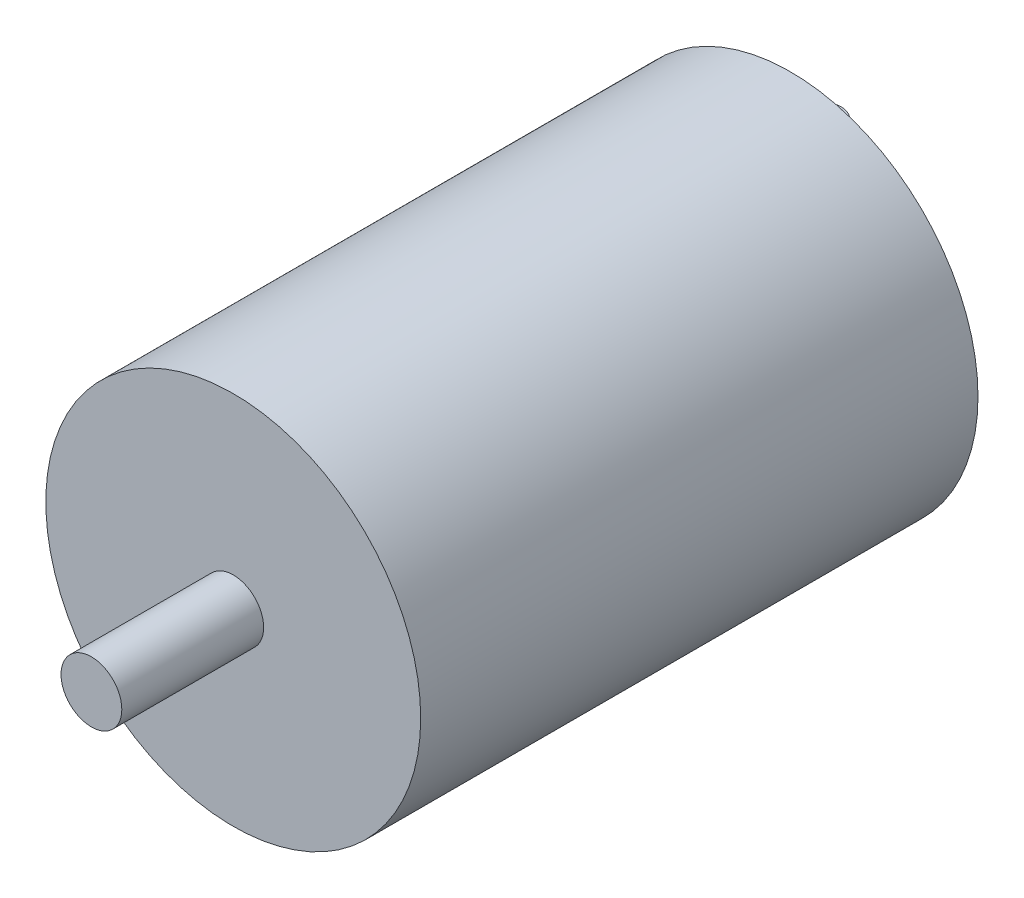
ISO-10303-21;
HEADER;
FILE_DESCRIPTION(('STEP AP214'),'2;1');
FILE_NAME('part.step','',(''),(''),'','','');
FILE_SCHEMA(('AUTOMOTIVE_DESIGN { 1 0 10303 214 1 1 1 1 }'));
ENDSEC;
DATA;
#1=APPLICATION_CONTEXT('core data for automotive mechanical design processes');
#2=APPLICATION_PROTOCOL_DEFINITION('international standard','automotive_design',2000,#1);
#3=PRODUCT_CONTEXT('',#1,'mechanical');
#4=PRODUCT('Part','Part','',(#3));
#5=PRODUCT_RELATED_PRODUCT_CATEGORY('part','',(#4));
#6=PRODUCT_DEFINITION_FORMATION('','',#4);
#7=PRODUCT_DEFINITION_CONTEXT('part definition',#1,'design');
#8=PRODUCT_DEFINITION('design','',#6,#7);
#9=PRODUCT_DEFINITION_SHAPE('','',#8);
#10=(LENGTH_UNIT() NAMED_UNIT(*) SI_UNIT(.MILLI.,.METRE.));
#11=(NAMED_UNIT(*) PLANE_ANGLE_UNIT() SI_UNIT($,.RADIAN.));
#12=(NAMED_UNIT(*) SI_UNIT($,.STERADIAN.) SOLID_ANGLE_UNIT());
#13=UNCERTAINTY_MEASURE_WITH_UNIT(LENGTH_MEASURE(1.E-05),#10,'distance_accuracy_value','');
#14=(GEOMETRIC_REPRESENTATION_CONTEXT(3) GLOBAL_UNCERTAINTY_ASSIGNED_CONTEXT((#13)) GLOBAL_UNIT_ASSIGNED_CONTEXT((#10,
#11,#12)) REPRESENTATION_CONTEXT('',''));
#15=CARTESIAN_POINT('',(0.,0.,0.));
#16=DIRECTION('',(0.,0.,1.));
#17=DIRECTION('',(1.,0.,0.));
#18=AXIS2_PLACEMENT_3D('',#15,#16,#17);
#19=CARTESIAN_POINT('',(0.,0.,0.));
#20=DIRECTION('',(0.,0.,1.));
#21=DIRECTION('',(1.,0.,0.));
#22=AXIS2_PLACEMENT_3D('',#19,#20,#21);
#23=PLANE('',#22);
#24=DIRECTION('',(0.,1.,0.));
#25=VECTOR('',#24,1.);
#26=CARTESIAN_POINT('',(-2.,-12.,0.));
#27=LINE('',#26,#25);
#28=CARTESIAN_POINT('',(-2.,-13.,0.));
#29=VERTEX_POINT('',#28);
#30=CARTESIAN_POINT('',(-2.,-12.,0.));
#31=VERTEX_POINT('',#30);
#32=EDGE_CURVE('E141',#29,#31,#27,.T.);
#33=ORIENTED_EDGE('',*,*,#32,.F.);
#34=DIRECTION('',(-1.,0.,0.));
#35=VECTOR('',#34,1.);
#36=CARTESIAN_POINT('',(2.,-13.,0.));
#37=LINE('',#36,#35);
#38=CARTESIAN_POINT('',(2.,-13.,0.));
#39=VERTEX_POINT('',#38);
#40=EDGE_CURVE('E174',#39,#29,#37,.T.);
#41=ORIENTED_EDGE('',*,*,#40,.F.);
#42=DIRECTION('',(0.,-1.,0.));
#43=VECTOR('',#42,1.);
#44=CARTESIAN_POINT('',(2.,-12.,0.));
#45=LINE('',#44,#43);
#46=CARTESIAN_POINT('',(2.,-12.,0.));
#47=VERTEX_POINT('',#46);
#48=EDGE_CURVE('E178',#47,#39,#45,.T.);
#49=ORIENTED_EDGE('',*,*,#48,.F.);
#50=DIRECTION('',(1.,0.,0.));
#51=VECTOR('',#50,1.);
#52=CARTESIAN_POINT('',(2.,-12.,0.));
#53=LINE('',#52,#51);
#54=EDGE_CURVE('E182',#31,#47,#53,.T.);
#55=ORIENTED_EDGE('',*,*,#54,.F.);
#56=EDGE_LOOP('',(#33,#41,#49,#55));
#57=FACE_BOUND('',#56,.T.);
#58=CARTESIAN_POINT('',(0.,0.,0.));
#59=DIRECTION('',(0.,0.,1.));
#60=DIRECTION('',(1.,0.,0.));
#61=AXIS2_PLACEMENT_3D('',#58,#59,#60);
#62=CIRCLE('',#61,18.5);
#63=CARTESIAN_POINT('',(18.5,0.,0.));
#64=VERTEX_POINT('',#63);
#65=EDGE_CURVE('E192',#64,#64,#62,.T.);
#66=ORIENTED_EDGE('',*,*,#65,.F.);
#67=EDGE_LOOP('',(#66));
#68=FACE_BOUND('',#67,.T.);
#69=DIRECTION('',(0.,1.,0.));
#70=VECTOR('',#69,1.);
#71=CARTESIAN_POINT('',(-2.,13.,0.));
#72=LINE('',#71,#70);
#73=CARTESIAN_POINT('',(-2.,12.,0.));
#74=VERTEX_POINT('',#73);
#75=CARTESIAN_POINT('',(-2.,13.,0.));
#76=VERTEX_POINT('',#75);
#77=EDGE_CURVE('E124',#74,#76,#72,.T.);
#78=ORIENTED_EDGE('',*,*,#77,.F.);
#79=DIRECTION('',(-1.,0.,0.));
#80=VECTOR('',#79,1.);
#81=CARTESIAN_POINT('',(2.,12.,0.));
#82=LINE('',#81,#80);
#83=CARTESIAN_POINT('',(2.,12.,0.));
#84=VERTEX_POINT('',#83);
#85=EDGE_CURVE('E131',#84,#74,#82,.T.);
#86=ORIENTED_EDGE('',*,*,#85,.F.);
#87=DIRECTION('',(0.,-1.,0.));
#88=VECTOR('',#87,1.);
#89=CARTESIAN_POINT('',(2.,13.,0.));
#90=LINE('',#89,#88);
#91=CARTESIAN_POINT('',(2.,13.,0.));
#92=VERTEX_POINT('',#91);
#93=EDGE_CURVE('E146',#92,#84,#90,.T.);
#94=ORIENTED_EDGE('',*,*,#93,.F.);
#95=DIRECTION('',(1.,0.,0.));
#96=VECTOR('',#95,1.);
#97=CARTESIAN_POINT('',(2.,13.,0.));
#98=LINE('',#97,#96);
#99=EDGE_CURVE('E139',#76,#92,#98,.T.);
#100=ORIENTED_EDGE('',*,*,#99,.F.);
#101=EDGE_LOOP('',(#78,#86,#94,#100));
#102=FACE_BOUND('',#101,.T.);
#103=ADVANCED_FACE('F45',(#57,#68,#102),#23,.F.);
#104=CARTESIAN_POINT('',(0.,0.,55.));
#105=DIRECTION('',(0.,0.,-1.));
#106=DIRECTION('',(-1.,0.,0.));
#107=AXIS2_PLACEMENT_3D('',#104,#105,#106);
#108=CYLINDRICAL_SURFACE('',#107,18.5);
#109=CARTESIAN_POINT('',(0.,0.,55.));
#110=DIRECTION('',(0.,0.,1.));
#111=DIRECTION('',(1.,0.,0.));
#112=AXIS2_PLACEMENT_3D('',#109,#110,#111);
#113=CIRCLE('',#112,18.5);
#114=CARTESIAN_POINT('',(18.5,0.,55.));
#115=VERTEX_POINT('',#114);
#116=EDGE_CURVE('E198',#115,#115,#113,.T.);
#117=ORIENTED_EDGE('',*,*,#116,.F.);
#118=EDGE_LOOP('',(#117));
#119=FACE_BOUND('',#118,.T.);
#120=ORIENTED_EDGE('',*,*,#65,.T.);
#121=EDGE_LOOP('',(#120));
#122=FACE_BOUND('',#121,.T.);
#123=ADVANCED_FACE('F287',(#119,#122),#108,.T.);
#124=CARTESIAN_POINT('',(0.,0.,55.));
#125=DIRECTION('',(0.,0.,1.));
#126=DIRECTION('',(1.,0.,0.));
#127=AXIS2_PLACEMENT_3D('',#124,#125,#126);
#128=PLANE('',#127);
#129=CARTESIAN_POINT('',(0.,0.,55.));
#130=DIRECTION('',(0.,0.,1.));
#131=DIRECTION('',(1.,0.,0.));
#132=AXIS2_PLACEMENT_3D('',#129,#130,#131);
#133=CIRCLE('',#132,3.);
#134=CARTESIAN_POINT('',(3.,0.,55.));
#135=VERTEX_POINT('',#134);
#136=EDGE_CURVE('E193',#135,#135,#133,.T.);
#137=ORIENTED_EDGE('',*,*,#136,.F.);
#138=EDGE_LOOP('',(#137));
#139=FACE_BOUND('',#138,.T.);
#140=ORIENTED_EDGE('',*,*,#116,.T.);
#141=EDGE_LOOP('',(#140));
#142=FACE_BOUND('',#141,.T.);
#143=ADVANCED_FACE('F294',(#139,#142),#128,.T.);
#144=CARTESIAN_POINT('',(0.,0.,69.));
#145=DIRECTION('',(0.,0.,-1.));
#146=DIRECTION('',(-1.,0.,0.));
#147=AXIS2_PLACEMENT_3D('',#144,#145,#146);
#148=CYLINDRICAL_SURFACE('',#147,3.);
#149=CARTESIAN_POINT('',(0.,0.,69.));
#150=DIRECTION('',(0.,0.,1.));
#151=DIRECTION('',(1.,0.,0.));
#152=AXIS2_PLACEMENT_3D('',#149,#150,#151);
#153=CIRCLE('',#152,3.);
#154=CARTESIAN_POINT('',(3.,0.,69.));
#155=VERTEX_POINT('',#154);
#156=EDGE_CURVE('E160',#155,#155,#153,.T.);
#157=ORIENTED_EDGE('',*,*,#156,.F.);
#158=EDGE_LOOP('',(#157));
#159=FACE_BOUND('',#158,.T.);
#160=ORIENTED_EDGE('',*,*,#136,.T.);
#161=EDGE_LOOP('',(#160));
#162=FACE_BOUND('',#161,.T.);
#163=ADVANCED_FACE('F415',(#159,#162),#148,.T.);
#164=CARTESIAN_POINT('',(0.,0.,69.));
#165=DIRECTION('',(0.,0.,1.));
#166=DIRECTION('',(1.,0.,0.));
#167=AXIS2_PLACEMENT_3D('',#164,#165,#166);
#168=PLANE('',#167);
#169=ORIENTED_EDGE('',*,*,#156,.T.);
#170=EDGE_LOOP('',(#169));
#171=FACE_BOUND('',#170,.T.);
#172=ADVANCED_FACE('F384',(#171),#168,.T.);
#173=CARTESIAN_POINT('',(-2.,-12.,-5.));
#174=DIRECTION('',(1.,0.,0.));
#175=DIRECTION('',(0.,0.,-1.));
#176=AXIS2_PLACEMENT_3D('',#173,#174,#175);
#177=PLANE('',#176);
#178=DIRECTION('',(0.,0.,1.));
#179=VECTOR('',#178,1.);
#180=CARTESIAN_POINT('',(-2.,-12.,-5.));
#181=LINE('',#180,#179);
#182=CARTESIAN_POINT('',(-2.,-12.,-3.));
#183=VERTEX_POINT('',#182);
#184=EDGE_CURVE('E161',#183,#31,#181,.T.);
#185=ORIENTED_EDGE('',*,*,#184,.F.);
#186=DIRECTION('',(0.,1.,0.));
#187=VECTOR('',#186,1.);
#188=CARTESIAN_POINT('',(-2.,-13.,-3.));
#189=LINE('',#188,#187);
#190=CARTESIAN_POINT('',(-2.,-13.,-3.));
#191=VERTEX_POINT('',#190);
#192=EDGE_CURVE('E226',#183,#191,#189,.F.);
#193=ORIENTED_EDGE('',*,*,#192,.T.);
#194=DIRECTION('',(0.,0.,1.));
#195=VECTOR('',#194,1.);
#196=CARTESIAN_POINT('',(-2.,-13.,-5.));
#197=LINE('',#196,#195);
#198=EDGE_CURVE('E171',#191,#29,#197,.T.);
#199=ORIENTED_EDGE('',*,*,#198,.T.);
#200=ORIENTED_EDGE('',*,*,#32,.T.);
#201=EDGE_LOOP('',(#185,#193,#199,#200));
#202=FACE_BOUND('',#201,.T.);
#203=ADVANCED_FACE('F376',(#202),#177,.F.);
#204=CARTESIAN_POINT('',(2.,-12.,-5.));
#205=DIRECTION('',(0.,-1.,0.));
#206=DIRECTION('',(0.,0.,-1.));
#207=AXIS2_PLACEMENT_3D('',#204,#205,#206);
#208=PLANE('',#207);
#209=CARTESIAN_POINT('',(0.,-12.,-3.2));
#210=DIRECTION('',(0.,-1.,0.));
#211=DIRECTION('',(0.,0.,-1.));
#212=AXIS2_PLACEMENT_3D('',#209,#210,#211);
#213=CIRCLE('',#212,0.75);
#214=CARTESIAN_POINT('',(0.,-12.,-3.95));
#215=VERTEX_POINT('',#214);
#216=EDGE_CURVE('E165',#215,#215,#213,.T.);
#217=ORIENTED_EDGE('',*,*,#216,.T.);
#218=EDGE_LOOP('',(#217));
#219=FACE_BOUND('',#218,.T.);
#220=DIRECTION('',(0.,0.,1.));
#221=VECTOR('',#220,1.);
#222=CARTESIAN_POINT('',(2.,-12.,-5.));
#223=LINE('',#222,#221);
#224=CARTESIAN_POINT('',(2.,-12.,-3.));
#225=VERTEX_POINT('',#224);
#226=EDGE_CURVE('E164',#225,#47,#223,.T.);
#227=ORIENTED_EDGE('',*,*,#226,.F.);
#228=CARTESIAN_POINT('',(0.,-12.,-3.));
#229=DIRECTION('',(0.,-1.,0.));
#230=DIRECTION('',(0.,0.,-1.));
#231=AXIS2_PLACEMENT_3D('',#228,#229,#230);
#232=CIRCLE('',#231,2.);
#233=CARTESIAN_POINT('',(0.,-12.,-5.));
#234=VERTEX_POINT('',#233);
#235=EDGE_CURVE('E223',#225,#234,#232,.F.);
#236=ORIENTED_EDGE('',*,*,#235,.T.);
#237=CARTESIAN_POINT('',(0.,-12.,-3.));
#238=DIRECTION('',(0.,-1.,0.));
#239=DIRECTION('',(0.,0.,-1.));
#240=AXIS2_PLACEMENT_3D('',#237,#238,#239);
#241=CIRCLE('',#240,2.);
#242=EDGE_CURVE('E220',#234,#183,#241,.F.);
#243=ORIENTED_EDGE('',*,*,#242,.T.);
#244=ORIENTED_EDGE('',*,*,#184,.T.);
#245=ORIENTED_EDGE('',*,*,#54,.T.);
#246=EDGE_LOOP('',(#227,#236,#243,#244,#245));
#247=FACE_BOUND('',#246,.T.);
#248=ADVANCED_FACE('F367',(#219,#247),#208,.F.);
#249=CARTESIAN_POINT('',(2.,-12.,-5.));
#250=DIRECTION('',(-1.,0.,0.));
#251=DIRECTION('',(0.,-1.,0.));
#252=AXIS2_PLACEMENT_3D('',#249,#250,#251);
#253=PLANE('',#252);
#254=DIRECTION('',(0.,0.,1.));
#255=VECTOR('',#254,1.);
#256=CARTESIAN_POINT('',(2.,-13.,-5.));
#257=LINE('',#256,#255);
#258=CARTESIAN_POINT('',(2.,-13.,-3.));
#259=VERTEX_POINT('',#258);
#260=EDGE_CURVE('E168',#259,#39,#257,.T.);
#261=ORIENTED_EDGE('',*,*,#260,.F.);
#262=DIRECTION('',(0.,-1.,0.));
#263=VECTOR('',#262,1.);
#264=CARTESIAN_POINT('',(2.,-12.,-3.));
#265=LINE('',#264,#263);
#266=EDGE_CURVE('E216',#259,#225,#265,.F.);
#267=ORIENTED_EDGE('',*,*,#266,.T.);
#268=ORIENTED_EDGE('',*,*,#226,.T.);
#269=ORIENTED_EDGE('',*,*,#48,.T.);
#270=EDGE_LOOP('',(#261,#267,#268,#269));
#271=FACE_BOUND('',#270,.T.);
#272=ADVANCED_FACE('F358',(#271),#253,.F.);
#273=CARTESIAN_POINT('',(2.,-13.,-5.));
#274=DIRECTION('',(0.,1.,0.));
#275=DIRECTION('',(0.,0.,1.));
#276=AXIS2_PLACEMENT_3D('',#273,#274,#275);
#277=PLANE('',#276);
#278=CARTESIAN_POINT('',(0.,-13.,-3.2));
#279=DIRECTION('',(0.,-1.,0.));
#280=DIRECTION('',(0.,0.,-1.));
#281=AXIS2_PLACEMENT_3D('',#278,#279,#280);
#282=CIRCLE('',#281,0.75);
#283=CARTESIAN_POINT('',(0.,-13.,-3.95));
#284=VERTEX_POINT('',#283);
#285=EDGE_CURVE('E210',#284,#284,#282,.T.);
#286=ORIENTED_EDGE('',*,*,#285,.F.);
#287=EDGE_LOOP('',(#286));
#288=FACE_BOUND('',#287,.T.);
#289=CARTESIAN_POINT('',(0.,-13.,-3.));
#290=DIRECTION('',(0.,1.,0.));
#291=DIRECTION('',(0.,0.,1.));
#292=AXIS2_PLACEMENT_3D('',#289,#290,#291);
#293=CIRCLE('',#292,2.);
#294=CARTESIAN_POINT('',(0.,-13.,-5.));
#295=VERTEX_POINT('',#294);
#296=EDGE_CURVE('E197',#191,#295,#293,.F.);
#297=ORIENTED_EDGE('',*,*,#296,.T.);
#298=CARTESIAN_POINT('',(0.,-13.,-3.));
#299=DIRECTION('',(0.,1.,0.));
#300=DIRECTION('',(0.,0.,1.));
#301=AXIS2_PLACEMENT_3D('',#298,#299,#300);
#302=CIRCLE('',#301,2.);
#303=EDGE_CURVE('E213',#295,#259,#302,.F.);
#304=ORIENTED_EDGE('',*,*,#303,.T.);
#305=ORIENTED_EDGE('',*,*,#260,.T.);
#306=ORIENTED_EDGE('',*,*,#40,.T.);
#307=ORIENTED_EDGE('',*,*,#198,.F.);
#308=EDGE_LOOP('',(#297,#304,#305,#306,#307));
#309=FACE_BOUND('',#308,.T.);
#310=ADVANCED_FACE('F350',(#288,#309),#277,.F.);
#311=CARTESIAN_POINT('',(-2.,13.,-5.));
#312=DIRECTION('',(1.,0.,0.));
#313=DIRECTION('',(0.,0.,-1.));
#314=AXIS2_PLACEMENT_3D('',#311,#312,#313);
#315=PLANE('',#314);
#316=DIRECTION('',(0.,0.,1.));
#317=VECTOR('',#316,1.);
#318=CARTESIAN_POINT('',(-2.,13.,-5.));
#319=LINE('',#318,#317);
#320=CARTESIAN_POINT('',(-2.,13.,-3.));
#321=VERTEX_POINT('',#320);
#322=EDGE_CURVE('E157',#321,#76,#319,.T.);
#323=ORIENTED_EDGE('',*,*,#322,.F.);
#324=DIRECTION('',(0.,1.,0.));
#325=VECTOR('',#324,1.);
#326=CARTESIAN_POINT('',(-2.,12.,-3.));
#327=LINE('',#326,#325);
#328=CARTESIAN_POINT('',(-2.,12.,-3.));
#329=VERTEX_POINT('',#328);
#330=EDGE_CURVE('E11',#321,#329,#327,.F.);
#331=ORIENTED_EDGE('',*,*,#330,.T.);
#332=DIRECTION('',(0.,0.,1.));
#333=VECTOR('',#332,1.);
#334=CARTESIAN_POINT('',(-2.,12.,-5.));
#335=LINE('',#334,#333);
#336=EDGE_CURVE('E121',#329,#74,#335,.T.);
#337=ORIENTED_EDGE('',*,*,#336,.T.);
#338=ORIENTED_EDGE('',*,*,#77,.T.);
#339=EDGE_LOOP('',(#323,#331,#337,#338));
#340=FACE_BOUND('',#339,.T.);
#341=ADVANCED_FACE('F123',(#340),#315,.F.);
#342=CARTESIAN_POINT('',(2.,13.,-5.));
#343=DIRECTION('',(0.,-1.,0.));
#344=DIRECTION('',(0.,0.,-1.));
#345=AXIS2_PLACEMENT_3D('',#342,#343,#344);
#346=PLANE('',#345);
#347=CARTESIAN_POINT('',(0.,13.,-3.2));
#348=DIRECTION('',(0.,-1.,0.));
#349=DIRECTION('',(0.,0.,-1.));
#350=AXIS2_PLACEMENT_3D('',#347,#348,#349);
#351=CIRCLE('',#350,0.75);
#352=CARTESIAN_POINT('',(0.,13.,-3.95));
#353=VERTEX_POINT('',#352);
#354=EDGE_CURVE('E209',#353,#353,#351,.T.);
#355=ORIENTED_EDGE('',*,*,#354,.T.);
#356=EDGE_LOOP('',(#355));
#357=FACE_BOUND('',#356,.T.);
#358=DIRECTION('',(0.,0.,1.));
#359=VECTOR('',#358,1.);
#360=CARTESIAN_POINT('',(2.,13.,-5.));
#361=LINE('',#360,#359);
#362=CARTESIAN_POINT('',(2.,13.,-3.));
#363=VERTEX_POINT('',#362);
#364=EDGE_CURVE('E154',#363,#92,#361,.T.);
#365=ORIENTED_EDGE('',*,*,#364,.F.);
#366=CARTESIAN_POINT('',(0.,13.,-3.));
#367=DIRECTION('',(0.,-1.,0.));
#368=DIRECTION('',(0.,0.,-1.));
#369=AXIS2_PLACEMENT_3D('',#366,#367,#368);
#370=CIRCLE('',#369,2.);
#371=CARTESIAN_POINT('',(0.,13.,-5.));
#372=VERTEX_POINT('',#371);
#373=EDGE_CURVE('E55',#363,#372,#370,.F.);
#374=ORIENTED_EDGE('',*,*,#373,.T.);
#375=CARTESIAN_POINT('',(0.,13.,-3.));
#376=DIRECTION('',(0.,-1.,0.));
#377=DIRECTION('',(0.,0.,-1.));
#378=AXIS2_PLACEMENT_3D('',#375,#376,#377);
#379=CIRCLE('',#378,2.);
#380=EDGE_CURVE('E63',#372,#321,#379,.F.);
#381=ORIENTED_EDGE('',*,*,#380,.T.);
#382=ORIENTED_EDGE('',*,*,#322,.T.);
#383=ORIENTED_EDGE('',*,*,#99,.T.);
#384=EDGE_LOOP('',(#365,#374,#381,#382,#383));
#385=FACE_BOUND('',#384,.T.);
#386=ADVANCED_FACE('F261',(#357,#385),#346,.F.);
#387=CARTESIAN_POINT('',(2.,13.,-5.));
#388=DIRECTION('',(-1.,0.,0.));
#389=DIRECTION('',(0.,-1.,0.));
#390=AXIS2_PLACEMENT_3D('',#387,#388,#389);
#391=PLANE('',#390);
#392=DIRECTION('',(0.,0.,1.));
#393=VECTOR('',#392,1.);
#394=CARTESIAN_POINT('',(2.,12.,-5.));
#395=LINE('',#394,#393);
#396=CARTESIAN_POINT('',(2.,12.,-3.));
#397=VERTEX_POINT('',#396);
#398=EDGE_CURVE('E130',#397,#84,#395,.T.);
#399=ORIENTED_EDGE('',*,*,#398,.F.);
#400=DIRECTION('',(0.,-1.,0.));
#401=VECTOR('',#400,1.);
#402=CARTESIAN_POINT('',(2.,13.,-3.));
#403=LINE('',#402,#401);
#404=EDGE_CURVE('E235',#397,#363,#403,.F.);
#405=ORIENTED_EDGE('',*,*,#404,.T.);
#406=ORIENTED_EDGE('',*,*,#364,.T.);
#407=ORIENTED_EDGE('',*,*,#93,.T.);
#408=EDGE_LOOP('',(#399,#405,#406,#407));
#409=FACE_BOUND('',#408,.T.);
#410=ADVANCED_FACE('F260',(#409),#391,.F.);
#411=CARTESIAN_POINT('',(2.,12.,-5.));
#412=DIRECTION('',(0.,1.,0.));
#413=DIRECTION('',(0.,0.,1.));
#414=AXIS2_PLACEMENT_3D('',#411,#412,#413);
#415=PLANE('',#414);
#416=CARTESIAN_POINT('',(0.,12.,-3.2));
#417=DIRECTION('',(0.,1.,0.));
#418=DIRECTION('',(0.,0.,1.));
#419=AXIS2_PLACEMENT_3D('',#416,#417,#418);
#420=CIRCLE('',#419,0.75);
#421=CARTESIAN_POINT('',(0.,12.,-2.45));
#422=VERTEX_POINT('',#421);
#423=EDGE_CURVE('E205',#422,#422,#420,.T.);
#424=ORIENTED_EDGE('',*,*,#423,.T.);
#425=EDGE_LOOP('',(#424));
#426=FACE_BOUND('',#425,.T.);
#427=CARTESIAN_POINT('',(0.,12.,-3.));
#428=DIRECTION('',(0.,1.,0.));
#429=DIRECTION('',(0.,0.,1.));
#430=AXIS2_PLACEMENT_3D('',#427,#428,#429);
#431=CIRCLE('',#430,2.);
#432=CARTESIAN_POINT('',(0.,12.,-5.));
#433=VERTEX_POINT('',#432);
#434=EDGE_CURVE('E229',#329,#433,#431,.F.);
#435=ORIENTED_EDGE('',*,*,#434,.T.);
#436=CARTESIAN_POINT('',(0.,12.,-3.));
#437=DIRECTION('',(0.,1.,0.));
#438=DIRECTION('',(0.,0.,1.));
#439=AXIS2_PLACEMENT_3D('',#436,#437,#438);
#440=CIRCLE('',#439,2.);
#441=EDGE_CURVE('E232',#433,#397,#440,.F.);
#442=ORIENTED_EDGE('',*,*,#441,.T.);
#443=ORIENTED_EDGE('',*,*,#398,.T.);
#444=ORIENTED_EDGE('',*,*,#85,.T.);
#445=ORIENTED_EDGE('',*,*,#336,.F.);
#446=EDGE_LOOP('',(#435,#442,#443,#444,#445));
#447=FACE_BOUND('',#446,.T.);
#448=ADVANCED_FACE('F143',(#426,#447),#415,.F.);
#449=CARTESIAN_POINT('',(0.,37.,-3.2));
#450=DIRECTION('',(0.,-1.,0.));
#451=DIRECTION('',(0.,0.,-1.));
#452=AXIS2_PLACEMENT_3D('',#449,#450,#451);
#453=CYLINDRICAL_SURFACE('',#452,0.75);
#454=ORIENTED_EDGE('',*,*,#423,.F.);
#455=EDGE_LOOP('',(#454));
#456=FACE_BOUND('',#455,.T.);
#457=ORIENTED_EDGE('',*,*,#354,.F.);
#458=EDGE_LOOP('',(#457));
#459=FACE_BOUND('',#458,.T.);
#460=ADVANCED_FACE('F272',(#456,#459),#453,.F.);
#461=ORIENTED_EDGE('',*,*,#285,.T.);
#462=EDGE_LOOP('',(#461));
#463=FACE_BOUND('',#462,.T.);
#464=ORIENTED_EDGE('',*,*,#216,.F.);
#465=EDGE_LOOP('',(#464));
#466=FACE_BOUND('',#465,.T.);
#467=ADVANCED_FACE('F274',(#463,#466),#453,.F.);
#468=CARTESIAN_POINT('',(0.,0.,-3.));
#469=DIRECTION('',(0.,-1.,0.));
#470=DIRECTION('',(0.,0.,-1.));
#471=AXIS2_PLACEMENT_3D('',#468,#469,#470);
#472=CYLINDRICAL_SURFACE('',#471,2.);
#473=ORIENTED_EDGE('',*,*,#192,.F.);
#474=ORIENTED_EDGE('',*,*,#242,.F.);
#475=DIRECTION('',(0.,1.,0.));
#476=VECTOR('',#475,1.);
#477=CARTESIAN_POINT('',(0.,-12.,-5.));
#478=LINE('',#477,#476);
#479=EDGE_CURVE('E242',#295,#234,#478,.T.);
#480=ORIENTED_EDGE('',*,*,#479,.F.);
#481=ORIENTED_EDGE('',*,*,#296,.F.);
#482=EDGE_LOOP('',(#473,#474,#480,#481));
#483=FACE_BOUND('',#482,.T.);
#484=ADVANCED_FACE('F281',(#483),#472,.T.);
#485=CARTESIAN_POINT('',(0.,0.,-3.));
#486=DIRECTION('',(0.,1.,0.));
#487=DIRECTION('',(-1.,0.,0.));
#488=AXIS2_PLACEMENT_3D('',#485,#486,#487);
#489=CYLINDRICAL_SURFACE('',#488,2.);
#490=ORIENTED_EDGE('',*,*,#235,.F.);
#491=ORIENTED_EDGE('',*,*,#266,.F.);
#492=ORIENTED_EDGE('',*,*,#303,.F.);
#493=ORIENTED_EDGE('',*,*,#479,.T.);
#494=EDGE_LOOP('',(#490,#491,#492,#493));
#495=FACE_BOUND('',#494,.T.);
#496=ADVANCED_FACE('F302',(#495),#489,.T.);
#497=CARTESIAN_POINT('',(0.,0.,-3.));
#498=DIRECTION('',(0.,-1.,0.));
#499=DIRECTION('',(0.,0.,-1.));
#500=AXIS2_PLACEMENT_3D('',#497,#498,#499);
#501=CYLINDRICAL_SURFACE('',#500,2.);
#502=ORIENTED_EDGE('',*,*,#330,.F.);
#503=ORIENTED_EDGE('',*,*,#380,.F.);
#504=DIRECTION('',(0.,1.,0.));
#505=VECTOR('',#504,1.);
#506=CARTESIAN_POINT('',(0.,13.,-5.));
#507=LINE('',#506,#505);
#508=EDGE_CURVE('E49',#433,#372,#507,.T.);
#509=ORIENTED_EDGE('',*,*,#508,.F.);
#510=ORIENTED_EDGE('',*,*,#434,.F.);
#511=EDGE_LOOP('',(#502,#503,#509,#510));
#512=FACE_BOUND('',#511,.T.);
#513=ADVANCED_FACE('F47',(#512),#501,.T.);
#514=CARTESIAN_POINT('',(0.,0.,-3.));
#515=DIRECTION('',(0.,1.,0.));
#516=DIRECTION('',(-1.,0.,0.));
#517=AXIS2_PLACEMENT_3D('',#514,#515,#516);
#518=CYLINDRICAL_SURFACE('',#517,2.);
#519=ORIENTED_EDGE('',*,*,#373,.F.);
#520=ORIENTED_EDGE('',*,*,#404,.F.);
#521=ORIENTED_EDGE('',*,*,#441,.F.);
#522=ORIENTED_EDGE('',*,*,#508,.T.);
#523=EDGE_LOOP('',(#519,#520,#521,#522));
#524=FACE_BOUND('',#523,.T.);
#525=ADVANCED_FACE('F256',(#524),#518,.T.);
#526=CLOSED_SHELL('',(#103,#123,#143,#163,#172,#203,#248,#272,#310,#341,#386,#410,#448,#460,
#467,#484,#496,#513,#525));
#527=MANIFOLD_SOLID_BREP('B2',#526);
#528=ADVANCED_BREP_SHAPE_REPRESENTATION('',(#18,#527),#14);
#529=SHAPE_DEFINITION_REPRESENTATION(#9,#528);
ENDSEC;
END-ISO-10303-21;
